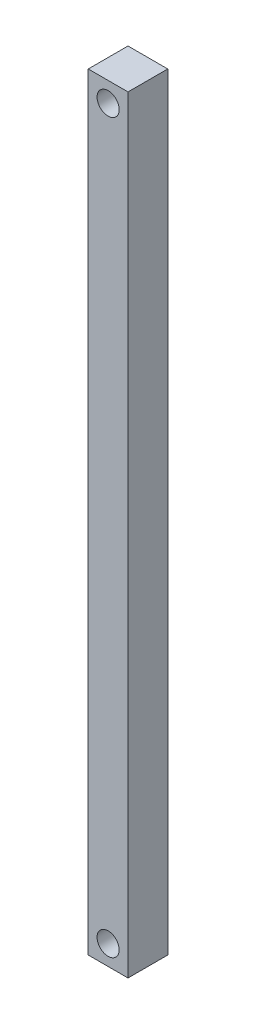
ISO-10303-21;
HEADER;
FILE_DESCRIPTION(('STEP AP214'),'2;1');
FILE_NAME('part.step','',(''),(''),'','','');
FILE_SCHEMA(('AUTOMOTIVE_DESIGN { 1 0 10303 214 1 1 1 1 }'));
ENDSEC;
DATA;
#1=APPLICATION_CONTEXT('core data for automotive mechanical design processes');
#2=APPLICATION_PROTOCOL_DEFINITION('international standard','automotive_design',2000,#1);
#3=PRODUCT_CONTEXT('',#1,'mechanical');
#4=PRODUCT('Part','Part','',(#3));
#5=PRODUCT_RELATED_PRODUCT_CATEGORY('part','',(#4));
#6=PRODUCT_DEFINITION_FORMATION('','',#4);
#7=PRODUCT_DEFINITION_CONTEXT('part definition',#1,'design');
#8=PRODUCT_DEFINITION('design','',#6,#7);
#9=PRODUCT_DEFINITION_SHAPE('','',#8);
#10=(LENGTH_UNIT() NAMED_UNIT(*) SI_UNIT(.MILLI.,.METRE.));
#11=(NAMED_UNIT(*) PLANE_ANGLE_UNIT() SI_UNIT($,.RADIAN.));
#12=(NAMED_UNIT(*) SI_UNIT($,.STERADIAN.) SOLID_ANGLE_UNIT());
#13=UNCERTAINTY_MEASURE_WITH_UNIT(LENGTH_MEASURE(1.E-05),#10,'distance_accuracy_value','');
#14=(GEOMETRIC_REPRESENTATION_CONTEXT(3) GLOBAL_UNCERTAINTY_ASSIGNED_CONTEXT((#13)) GLOBAL_UNIT_ASSIGNED_CONTEXT((#10,
#11,#12)) REPRESENTATION_CONTEXT('',''));
#15=CARTESIAN_POINT('',(0.,0.,0.));
#16=DIRECTION('',(0.,0.,1.));
#17=DIRECTION('',(1.,0.,0.));
#18=AXIS2_PLACEMENT_3D('',#15,#16,#17);
#19=CARTESIAN_POINT('',(0.,0.,18.7));
#20=DIRECTION('',(0.,0.,-1.));
#21=DIRECTION('',(-1.,0.,0.));
#22=AXIS2_PLACEMENT_3D('',#19,#20,#21);
#23=PLANE('',#22);
#24=DIRECTION('',(0.,-1.,0.));
#25=VECTOR('',#24,1.);
#26=CARTESIAN_POINT('',(-3.76965671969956,0.,18.7));
#27=LINE('',#26,#25);
#28=CARTESIAN_POINT('',(-3.76965671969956,361.,18.7));
#29=VERTEX_POINT('',#28);
#30=CARTESIAN_POINT('',(-3.76965671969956,0.,18.7));
#31=VERTEX_POINT('',#30);
#32=EDGE_CURVE('E98',#29,#31,#27,.T.);
#33=ORIENTED_EDGE('',*,*,#32,.T.);
#34=DIRECTION('',(1.,0.,0.));
#35=VECTOR('',#34,1.);
#36=CARTESIAN_POINT('',(-3.76965671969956,0.,18.7));
#37=LINE('',#36,#35);
#38=CARTESIAN_POINT('',(14.9303432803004,0.,18.7));
#39=VERTEX_POINT('',#38);
#40=EDGE_CURVE('E93',#31,#39,#37,.T.);
#41=ORIENTED_EDGE('',*,*,#40,.T.);
#42=DIRECTION('',(0.,1.,0.));
#43=VECTOR('',#42,1.);
#44=CARTESIAN_POINT('',(14.9303432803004,0.,18.7));
#45=LINE('',#44,#43);
#46=CARTESIAN_POINT('',(14.9303432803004,361.,18.7));
#47=VERTEX_POINT('',#46);
#48=EDGE_CURVE('E96',#39,#47,#45,.T.);
#49=ORIENTED_EDGE('',*,*,#48,.T.);
#50=DIRECTION('',(-1.,0.,0.));
#51=VECTOR('',#50,1.);
#52=CARTESIAN_POINT('',(-3.76965671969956,361.,18.7));
#53=LINE('',#52,#51);
#54=EDGE_CURVE('E63',#47,#29,#53,.T.);
#55=ORIENTED_EDGE('',*,*,#54,.T.);
#56=EDGE_LOOP('',(#33,#41,#49,#55));
#57=FACE_BOUND('',#56,.T.);
#58=CARTESIAN_POINT('',(5.58034328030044,351.65,18.7));
#59=DIRECTION('',(0.,0.,1.));
#60=DIRECTION('',(1.,0.,0.));
#61=AXIS2_PLACEMENT_3D('',#58,#59,#60);
#62=CIRCLE('',#61,5.19999999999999);
#63=CARTESIAN_POINT('',(10.7803432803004,351.65,18.7));
#64=VERTEX_POINT('',#63);
#65=EDGE_CURVE('E118',#64,#64,#62,.T.);
#66=ORIENTED_EDGE('',*,*,#65,.F.);
#67=EDGE_LOOP('',(#66));
#68=FACE_BOUND('',#67,.T.);
#69=CARTESIAN_POINT('',(5.58034328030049,9.35,18.7));
#70=DIRECTION('',(0.,0.,1.));
#71=DIRECTION('',(1.,0.,0.));
#72=AXIS2_PLACEMENT_3D('',#69,#70,#71);
#73=CIRCLE('',#72,5.2);
#74=CARTESIAN_POINT('',(10.7803432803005,9.35,18.7));
#75=VERTEX_POINT('',#74);
#76=EDGE_CURVE('E140',#75,#75,#73,.T.);
#77=ORIENTED_EDGE('',*,*,#76,.F.);
#78=EDGE_LOOP('',(#77));
#79=FACE_BOUND('',#78,.T.);
#80=ADVANCED_FACE('F45',(#57,#68,#79),#23,.F.);
#81=CARTESIAN_POINT('',(0.,0.,0.));
#82=DIRECTION('',(0.,0.,-1.));
#83=DIRECTION('',(-1.,0.,0.));
#84=AXIS2_PLACEMENT_3D('',#81,#82,#83);
#85=PLANE('',#84);
#86=CARTESIAN_POINT('',(5.58034328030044,351.65,0.));
#87=DIRECTION('',(0.,0.,1.));
#88=DIRECTION('',(1.,0.,0.));
#89=AXIS2_PLACEMENT_3D('',#86,#87,#88);
#90=CIRCLE('',#89,5.19999999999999);
#91=CARTESIAN_POINT('',(10.7803432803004,351.65,0.));
#92=VERTEX_POINT('',#91);
#93=EDGE_CURVE('E136',#92,#92,#90,.T.);
#94=ORIENTED_EDGE('',*,*,#93,.T.);
#95=EDGE_LOOP('',(#94));
#96=FACE_BOUND('',#95,.T.);
#97=DIRECTION('',(0.,-1.,0.));
#98=VECTOR('',#97,1.);
#99=CARTESIAN_POINT('',(-3.76965671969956,0.,0.));
#100=LINE('',#99,#98);
#101=CARTESIAN_POINT('',(-3.76965671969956,361.,0.));
#102=VERTEX_POINT('',#101);
#103=CARTESIAN_POINT('',(-3.76965671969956,0.,0.));
#104=VERTEX_POINT('',#103);
#105=EDGE_CURVE('E114',#102,#104,#100,.T.);
#106=ORIENTED_EDGE('',*,*,#105,.F.);
#107=DIRECTION('',(-1.,0.,0.));
#108=VECTOR('',#107,1.);
#109=CARTESIAN_POINT('',(-3.76965671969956,361.,0.));
#110=LINE('',#109,#108);
#111=CARTESIAN_POINT('',(14.9303432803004,361.,0.));
#112=VERTEX_POINT('',#111);
#113=EDGE_CURVE('E86',#112,#102,#110,.T.);
#114=ORIENTED_EDGE('',*,*,#113,.F.);
#115=DIRECTION('',(0.,1.,0.));
#116=VECTOR('',#115,1.);
#117=CARTESIAN_POINT('',(14.9303432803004,0.,0.));
#118=LINE('',#117,#116);
#119=CARTESIAN_POINT('',(14.9303432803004,0.,0.));
#120=VERTEX_POINT('',#119);
#121=EDGE_CURVE('E80',#120,#112,#118,.T.);
#122=ORIENTED_EDGE('',*,*,#121,.F.);
#123=DIRECTION('',(1.,0.,0.));
#124=VECTOR('',#123,1.);
#125=CARTESIAN_POINT('',(-3.76965671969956,0.,0.));
#126=LINE('',#125,#124);
#127=EDGE_CURVE('E103',#104,#120,#126,.T.);
#128=ORIENTED_EDGE('',*,*,#127,.F.);
#129=EDGE_LOOP('',(#106,#114,#122,#128));
#130=FACE_BOUND('',#129,.T.);
#131=CARTESIAN_POINT('',(5.58034328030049,9.35,0.));
#132=DIRECTION('',(0.,0.,1.));
#133=DIRECTION('',(1.,0.,0.));
#134=AXIS2_PLACEMENT_3D('',#131,#132,#133);
#135=CIRCLE('',#134,5.2);
#136=CARTESIAN_POINT('',(10.7803432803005,9.35,0.));
#137=VERTEX_POINT('',#136);
#138=EDGE_CURVE('E144',#137,#137,#135,.T.);
#139=ORIENTED_EDGE('',*,*,#138,.T.);
#140=EDGE_LOOP('',(#139));
#141=FACE_BOUND('',#140,.T.);
#142=ADVANCED_FACE('F131',(#96,#130,#141),#85,.T.);
#143=CARTESIAN_POINT('',(-3.76965671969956,0.,18.7));
#144=DIRECTION('',(1.,0.,0.));
#145=DIRECTION('',(0.,0.,-1.));
#146=AXIS2_PLACEMENT_3D('',#143,#144,#145);
#147=PLANE('',#146);
#148=ORIENTED_EDGE('',*,*,#105,.T.);
#149=DIRECTION('',(0.,0.,-1.));
#150=VECTOR('',#149,1.);
#151=CARTESIAN_POINT('',(-3.76965671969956,0.,18.7));
#152=LINE('',#151,#150);
#153=EDGE_CURVE('E11',#31,#104,#152,.T.);
#154=ORIENTED_EDGE('',*,*,#153,.F.);
#155=ORIENTED_EDGE('',*,*,#32,.F.);
#156=DIRECTION('',(0.,0.,-1.));
#157=VECTOR('',#156,1.);
#158=CARTESIAN_POINT('',(-3.76965671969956,361.,18.7));
#159=LINE('',#158,#157);
#160=EDGE_CURVE('E110',#29,#102,#159,.T.);
#161=ORIENTED_EDGE('',*,*,#160,.T.);
#162=EDGE_LOOP('',(#148,#154,#155,#161));
#163=FACE_BOUND('',#162,.T.);
#164=ADVANCED_FACE('F47',(#163),#147,.F.);
#165=CARTESIAN_POINT('',(-3.76965671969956,0.,18.7));
#166=DIRECTION('',(0.,1.,0.));
#167=DIRECTION('',(0.,0.,1.));
#168=AXIS2_PLACEMENT_3D('',#165,#166,#167);
#169=PLANE('',#168);
#170=ORIENTED_EDGE('',*,*,#127,.T.);
#171=DIRECTION('',(0.,0.,-1.));
#172=VECTOR('',#171,1.);
#173=CARTESIAN_POINT('',(14.9303432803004,0.,18.7));
#174=LINE('',#173,#172);
#175=EDGE_CURVE('E55',#39,#120,#174,.T.);
#176=ORIENTED_EDGE('',*,*,#175,.F.);
#177=ORIENTED_EDGE('',*,*,#40,.F.);
#178=ORIENTED_EDGE('',*,*,#153,.T.);
#179=EDGE_LOOP('',(#170,#176,#177,#178));
#180=FACE_BOUND('',#179,.T.);
#181=ADVANCED_FACE('F102',(#180),#169,.F.);
#182=CARTESIAN_POINT('',(14.9303432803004,0.,18.7));
#183=DIRECTION('',(-1.,0.,0.));
#184=DIRECTION('',(0.,0.,1.));
#185=AXIS2_PLACEMENT_3D('',#182,#183,#184);
#186=PLANE('',#185);
#187=ORIENTED_EDGE('',*,*,#121,.T.);
#188=DIRECTION('',(0.,0.,-1.));
#189=VECTOR('',#188,1.);
#190=CARTESIAN_POINT('',(14.9303432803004,361.,18.7));
#191=LINE('',#190,#189);
#192=EDGE_CURVE('E105',#47,#112,#191,.T.);
#193=ORIENTED_EDGE('',*,*,#192,.F.);
#194=ORIENTED_EDGE('',*,*,#48,.F.);
#195=ORIENTED_EDGE('',*,*,#175,.T.);
#196=EDGE_LOOP('',(#187,#193,#194,#195));
#197=FACE_BOUND('',#196,.T.);
#198=ADVANCED_FACE('F106',(#197),#186,.F.);
#199=CARTESIAN_POINT('',(-3.76965671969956,361.,18.7));
#200=DIRECTION('',(0.,-1.,0.));
#201=DIRECTION('',(0.,0.,-1.));
#202=AXIS2_PLACEMENT_3D('',#199,#200,#201);
#203=PLANE('',#202);
#204=ORIENTED_EDGE('',*,*,#113,.T.);
#205=ORIENTED_EDGE('',*,*,#160,.F.);
#206=ORIENTED_EDGE('',*,*,#54,.F.);
#207=ORIENTED_EDGE('',*,*,#192,.T.);
#208=EDGE_LOOP('',(#204,#205,#206,#207));
#209=FACE_BOUND('',#208,.T.);
#210=ADVANCED_FACE('F128',(#209),#203,.F.);
#211=CARTESIAN_POINT('',(5.58034328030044,351.65,18.7));
#212=DIRECTION('',(0.,0.,-1.));
#213=DIRECTION('',(-1.,0.,0.));
#214=AXIS2_PLACEMENT_3D('',#211,#212,#213);
#215=CYLINDRICAL_SURFACE('',#214,5.19999999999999);
#216=ORIENTED_EDGE('',*,*,#65,.T.);
#217=EDGE_LOOP('',(#216));
#218=FACE_BOUND('',#217,.T.);
#219=ORIENTED_EDGE('',*,*,#93,.F.);
#220=EDGE_LOOP('',(#219));
#221=FACE_BOUND('',#220,.T.);
#222=ADVANCED_FACE('F163',(#218,#221),#215,.F.);
#223=CARTESIAN_POINT('',(5.58034328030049,9.35,18.7));
#224=DIRECTION('',(0.,0.,-1.));
#225=DIRECTION('',(-1.,0.,0.));
#226=AXIS2_PLACEMENT_3D('',#223,#224,#225);
#227=CYLINDRICAL_SURFACE('',#226,5.2);
#228=ORIENTED_EDGE('',*,*,#76,.T.);
#229=EDGE_LOOP('',(#228));
#230=FACE_BOUND('',#229,.T.);
#231=ORIENTED_EDGE('',*,*,#138,.F.);
#232=EDGE_LOOP('',(#231));
#233=FACE_BOUND('',#232,.T.);
#234=ADVANCED_FACE('F152',(#230,#233),#227,.F.);
#235=CLOSED_SHELL('',(#80,#142,#164,#181,#198,#210,#222,#234));
#236=MANIFOLD_SOLID_BREP('B2',#235);
#237=ADVANCED_BREP_SHAPE_REPRESENTATION('',(#18,#236),#14);
#238=SHAPE_DEFINITION_REPRESENTATION(#9,#237);
ENDSEC;
END-ISO-10303-21;
